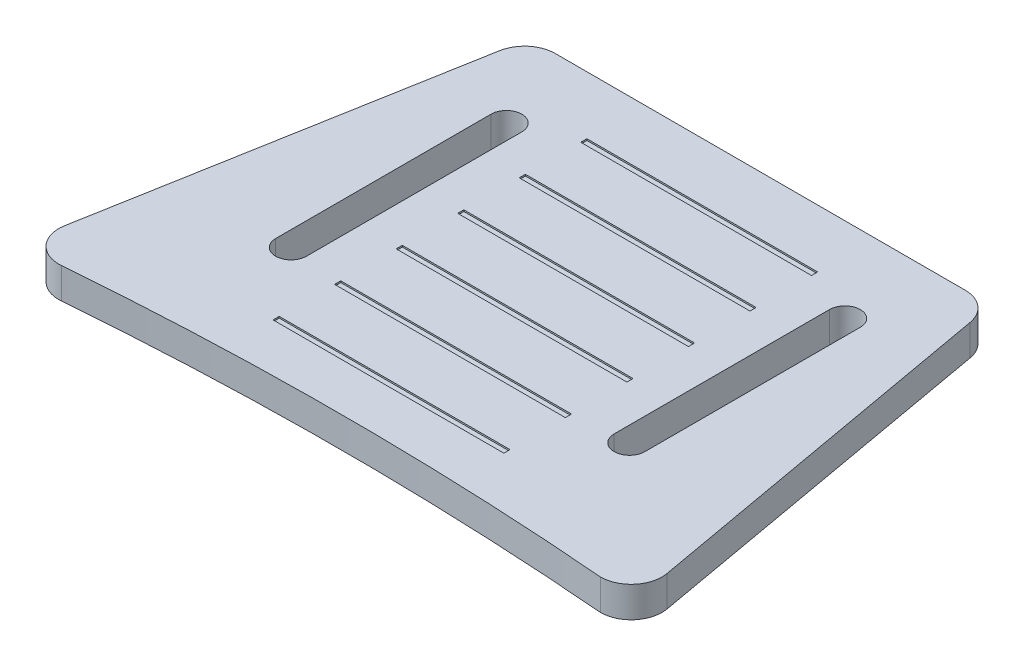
from build123d import *

# Parameters (mm, degrees)
RESSALTO_EXTRUS_O1_DEPTH = 2
ESBO_O2_W                = 15
ESBO_O2_H                = 0.4
CORTE_EXTRUS_O1_DEPTH    = 0.1
PADR_O_LINEAR1_COUNT     = 6
PADR_O_LINEAR1_PITCH     = 4


with BuildPart() as part:
    # Esbo_o1 → Ressalto-extrus_o1 (new body)
    with BuildSketch(Plane(origin=(0, 0, 0), x_dir=(1, 0, 0), z_dir=(0, 1, 0))):
        with BuildLine():
            Line((1.674494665, 0), (28.325505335, 0))
            ThreePointArc((28.325505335, 0), (29.609412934, -0.466513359), (30.294360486, -1.648418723))
            Line((30.294360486, -1.648418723), (34.580074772, -25.648418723))
            ThreePointArc((34.580074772, -25.648418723), (34.144706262, -27.283907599), (32.611219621, -28))
            ThreePointArc((32.611219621, -28), (15.082885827, -27.269989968), (-2.446011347, -27.98634468))
            ThreePointArc((-2.446011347, -27.98634468), (-4.089503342, -27.338819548), (-4.578838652, -25.641496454))
            Line((-4.578838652, -25.641496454), (-0.294360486, -1.648418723))
            ThreePointArc((-0.294360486, -1.648418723), (0.390587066, -0.466513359), (1.674494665, 0))
        make_face()
        with BuildLine():
            Line((5, -5.5), (5, -19.5))
            ThreePointArc((5, -19.5), (4, -20.5), (3, -19.5))
            Line((3, -19.5), (3, -5.5))
            ThreePointArc((3, -5.5), (4, -4.5), (5, -5.5))
        make_face(mode=Mode.SUBTRACT)
        with BuildLine():
            Line((25, -5.5), (25, -19.5))
            ThreePointArc((25, -19.5), (26, -20.5), (27, -19.5))
            Line((27, -19.5), (27, -5.5))
            ThreePointArc((27, -5.5), (26, -4.5), (25, -5.5))
        make_face(mode=Mode.SUBTRACT)
    extrude(amount=RESSALTO_EXTRUS_O1_DEPTH)

    # Esbo_o2 → Corte-extrus_o1 (cut)
    with BuildSketch(Plane(origin=(0, 2, 0), x_dir=(1, 0, 0), z_dir=(0, 1, 0))):
        with Locations((15, -23.969622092)):
            Rectangle(ESBO_O2_W, ESBO_O2_H)
    corte_extrus_o1 = extrude(amount=-CORTE_EXTRUS_O1_DEPTH, mode=Mode.SUBTRACT)

    # Padr_o linear1: Corte-extrus_o1 ×6
    with Locations(*[(0, 0, -i * PADR_O_LINEAR1_PITCH) for i in range(1, PADR_O_LINEAR1_COUNT)]):
        add(corte_extrus_o1, mode=Mode.SUBTRACT)


solid = part.part
